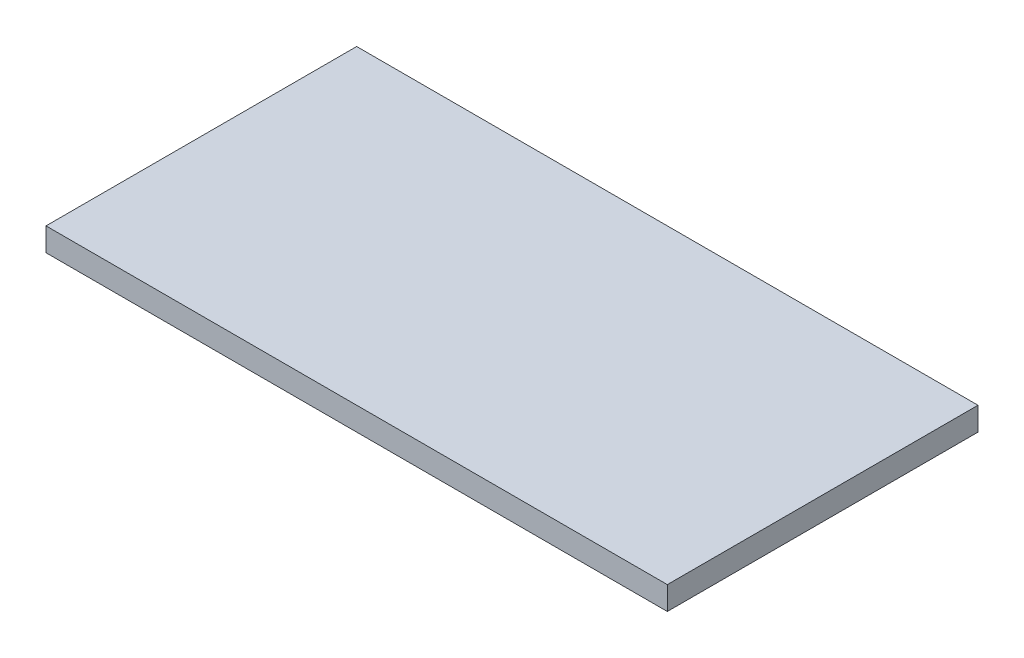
ISO-10303-21;
HEADER;
FILE_DESCRIPTION(('STEP AP214'),'2;1');
FILE_NAME('part.step','',(''),(''),'','','');
FILE_SCHEMA(('AUTOMOTIVE_DESIGN { 1 0 10303 214 1 1 1 1 }'));
ENDSEC;
DATA;
#1=APPLICATION_CONTEXT('core data for automotive mechanical design processes');
#2=APPLICATION_PROTOCOL_DEFINITION('international standard','automotive_design',2000,#1);
#3=PRODUCT_CONTEXT('',#1,'mechanical');
#4=PRODUCT('Part','Part','',(#3));
#5=PRODUCT_RELATED_PRODUCT_CATEGORY('part','',(#4));
#6=PRODUCT_DEFINITION_FORMATION('','',#4);
#7=PRODUCT_DEFINITION_CONTEXT('part definition',#1,'design');
#8=PRODUCT_DEFINITION('design','',#6,#7);
#9=PRODUCT_DEFINITION_SHAPE('','',#8);
#10=(LENGTH_UNIT() NAMED_UNIT(*) SI_UNIT(.MILLI.,.METRE.));
#11=(NAMED_UNIT(*) PLANE_ANGLE_UNIT() SI_UNIT($,.RADIAN.));
#12=(NAMED_UNIT(*) SI_UNIT($,.STERADIAN.) SOLID_ANGLE_UNIT());
#13=UNCERTAINTY_MEASURE_WITH_UNIT(LENGTH_MEASURE(1.E-05),#10,'distance_accuracy_value','');
#14=(GEOMETRIC_REPRESENTATION_CONTEXT(3) GLOBAL_UNCERTAINTY_ASSIGNED_CONTEXT((#13)) GLOBAL_UNIT_ASSIGNED_CONTEXT((#10,
#11,#12)) REPRESENTATION_CONTEXT('',''));
#15=CARTESIAN_POINT('',(0.,0.,0.));
#16=DIRECTION('',(0.,0.,1.));
#17=DIRECTION('',(1.,0.,0.));
#18=AXIS2_PLACEMENT_3D('',#15,#16,#17);
#19=CARTESIAN_POINT('',(63.4999999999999,4.7625,31.75));
#20=DIRECTION('',(-1.,0.,0.));
#21=DIRECTION('',(0.,0.,1.));
#22=AXIS2_PLACEMENT_3D('',#19,#20,#21);
#23=PLANE('',#22);
#24=DIRECTION('',(0.,0.,-1.));
#25=VECTOR('',#24,1.);
#26=CARTESIAN_POINT('',(63.4999999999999,0.,31.75));
#27=LINE('',#26,#25);
#28=CARTESIAN_POINT('',(63.4999999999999,0.,31.75));
#29=VERTEX_POINT('',#28);
#30=CARTESIAN_POINT('',(63.4999999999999,0.,-31.75));
#31=VERTEX_POINT('',#30);
#32=EDGE_CURVE('E103',#29,#31,#27,.T.);
#33=ORIENTED_EDGE('',*,*,#32,.T.);
#34=DIRECTION('',(0.,-1.,0.));
#35=VECTOR('',#34,1.);
#36=CARTESIAN_POINT('',(63.4999999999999,4.7625,-31.75));
#37=LINE('',#36,#35);
#38=CARTESIAN_POINT('',(63.4999999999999,4.7625,-31.75));
#39=VERTEX_POINT('',#38);
#40=EDGE_CURVE('E11',#39,#31,#37,.T.);
#41=ORIENTED_EDGE('',*,*,#40,.F.);
#42=DIRECTION('',(0.,0.,-1.));
#43=VECTOR('',#42,1.);
#44=CARTESIAN_POINT('',(63.4999999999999,4.7625,31.75));
#45=LINE('',#44,#43);
#46=CARTESIAN_POINT('',(63.4999999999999,4.7625,31.75));
#47=VERTEX_POINT('',#46);
#48=EDGE_CURVE('E91',#47,#39,#45,.T.);
#49=ORIENTED_EDGE('',*,*,#48,.F.);
#50=DIRECTION('',(0.,-1.,0.));
#51=VECTOR('',#50,1.);
#52=CARTESIAN_POINT('',(63.4999999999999,4.7625,31.75));
#53=LINE('',#52,#51);
#54=EDGE_CURVE('E99',#47,#29,#53,.T.);
#55=ORIENTED_EDGE('',*,*,#54,.T.);
#56=EDGE_LOOP('',(#33,#41,#49,#55));
#57=FACE_BOUND('',#56,.T.);
#58=ADVANCED_FACE('F40',(#57),#23,.F.);
#59=CARTESIAN_POINT('',(-63.5000000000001,4.7625,-31.75));
#60=DIRECTION('',(0.,0.,1.));
#61=DIRECTION('',(1.,0.,0.));
#62=AXIS2_PLACEMENT_3D('',#59,#60,#61);
#63=PLANE('',#62);
#64=DIRECTION('',(-1.,0.,0.));
#65=VECTOR('',#64,1.);
#66=CARTESIAN_POINT('',(-63.5000000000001,0.,-31.75));
#67=LINE('',#66,#65);
#68=CARTESIAN_POINT('',(-63.5000000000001,0.,-31.75));
#69=VERTEX_POINT('',#68);
#70=EDGE_CURVE('E95',#31,#69,#67,.T.);
#71=ORIENTED_EDGE('',*,*,#70,.T.);
#72=DIRECTION('',(0.,-1.,0.));
#73=VECTOR('',#72,1.);
#74=CARTESIAN_POINT('',(-63.5000000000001,4.7625,-31.75));
#75=LINE('',#74,#73);
#76=CARTESIAN_POINT('',(-63.5000000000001,4.7625,-31.75));
#77=VERTEX_POINT('',#76);
#78=EDGE_CURVE('E48',#77,#69,#75,.T.);
#79=ORIENTED_EDGE('',*,*,#78,.F.);
#80=DIRECTION('',(-1.,0.,0.));
#81=VECTOR('',#80,1.);
#82=CARTESIAN_POINT('',(-63.5000000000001,4.7625,-31.75));
#83=LINE('',#82,#81);
#84=EDGE_CURVE('E86',#39,#77,#83,.T.);
#85=ORIENTED_EDGE('',*,*,#84,.F.);
#86=ORIENTED_EDGE('',*,*,#40,.T.);
#87=EDGE_LOOP('',(#71,#79,#85,#86));
#88=FACE_BOUND('',#87,.T.);
#89=ADVANCED_FACE('F94',(#88),#63,.F.);
#90=CARTESIAN_POINT('',(-63.5000000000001,4.7625,31.75));
#91=DIRECTION('',(1.,0.,0.));
#92=DIRECTION('',(0.,0.,-1.));
#93=AXIS2_PLACEMENT_3D('',#90,#91,#92);
#94=PLANE('',#93);
#95=DIRECTION('',(0.,0.,1.));
#96=VECTOR('',#95,1.);
#97=CARTESIAN_POINT('',(-63.5000000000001,0.,31.75));
#98=LINE('',#97,#96);
#99=CARTESIAN_POINT('',(-63.5000000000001,0.,31.75));
#100=VERTEX_POINT('',#99);
#101=EDGE_CURVE('E73',#69,#100,#98,.T.);
#102=ORIENTED_EDGE('',*,*,#101,.T.);
#103=DIRECTION('',(0.,-1.,0.));
#104=VECTOR('',#103,1.);
#105=CARTESIAN_POINT('',(-63.5000000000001,4.7625,31.75));
#106=LINE('',#105,#104);
#107=CARTESIAN_POINT('',(-63.5000000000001,4.7625,31.75));
#108=VERTEX_POINT('',#107);
#109=EDGE_CURVE('E96',#108,#100,#106,.T.);
#110=ORIENTED_EDGE('',*,*,#109,.F.);
#111=DIRECTION('',(0.,0.,1.));
#112=VECTOR('',#111,1.);
#113=CARTESIAN_POINT('',(-63.5000000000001,4.7625,31.75));
#114=LINE('',#113,#112);
#115=EDGE_CURVE('E89',#77,#108,#114,.T.);
#116=ORIENTED_EDGE('',*,*,#115,.F.);
#117=ORIENTED_EDGE('',*,*,#78,.T.);
#118=EDGE_LOOP('',(#102,#110,#116,#117));
#119=FACE_BOUND('',#118,.T.);
#120=ADVANCED_FACE('F97',(#119),#94,.F.);
#121=CARTESIAN_POINT('',(-63.5000000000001,4.7625,31.75));
#122=DIRECTION('',(0.,0.,-1.));
#123=DIRECTION('',(-1.,0.,0.));
#124=AXIS2_PLACEMENT_3D('',#121,#122,#123);
#125=PLANE('',#124);
#126=DIRECTION('',(1.,0.,0.));
#127=VECTOR('',#126,1.);
#128=CARTESIAN_POINT('',(-63.5000000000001,0.,31.75));
#129=LINE('',#128,#127);
#130=EDGE_CURVE('E79',#100,#29,#129,.T.);
#131=ORIENTED_EDGE('',*,*,#130,.T.);
#132=ORIENTED_EDGE('',*,*,#54,.F.);
#133=DIRECTION('',(1.,0.,0.));
#134=VECTOR('',#133,1.);
#135=CARTESIAN_POINT('',(-63.5000000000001,4.7625,31.75));
#136=LINE('',#135,#134);
#137=EDGE_CURVE('E56',#108,#47,#136,.T.);
#138=ORIENTED_EDGE('',*,*,#137,.F.);
#139=ORIENTED_EDGE('',*,*,#109,.T.);
#140=EDGE_LOOP('',(#131,#132,#138,#139));
#141=FACE_BOUND('',#140,.T.);
#142=ADVANCED_FACE('F110',(#141),#125,.F.);
#143=CARTESIAN_POINT('',(0.,4.7625,0.));
#144=DIRECTION('',(0.,-1.,0.));
#145=DIRECTION('',(0.,0.,-1.));
#146=AXIS2_PLACEMENT_3D('',#143,#144,#145);
#147=PLANE('',#146);
#148=ORIENTED_EDGE('',*,*,#48,.T.);
#149=ORIENTED_EDGE('',*,*,#84,.T.);
#150=ORIENTED_EDGE('',*,*,#115,.T.);
#151=ORIENTED_EDGE('',*,*,#137,.T.);
#152=EDGE_LOOP('',(#148,#149,#150,#151));
#153=FACE_BOUND('',#152,.T.);
#154=ADVANCED_FACE('F87',(#153),#147,.F.);
#155=CARTESIAN_POINT('',(0.,0.,0.));
#156=DIRECTION('',(0.,-1.,0.));
#157=DIRECTION('',(0.,0.,-1.));
#158=AXIS2_PLACEMENT_3D('',#155,#156,#157);
#159=PLANE('',#158);
#160=ORIENTED_EDGE('',*,*,#32,.F.);
#161=ORIENTED_EDGE('',*,*,#130,.F.);
#162=ORIENTED_EDGE('',*,*,#101,.F.);
#163=ORIENTED_EDGE('',*,*,#70,.F.);
#164=EDGE_LOOP('',(#160,#161,#162,#163));
#165=FACE_BOUND('',#164,.T.);
#166=ADVANCED_FACE('F113',(#165),#159,.T.);
#167=CLOSED_SHELL('',(#58,#89,#120,#142,#154,#166));
#168=MANIFOLD_SOLID_BREP('B2',#167);
#169=ADVANCED_BREP_SHAPE_REPRESENTATION('',(#18,#168),#14);
#170=SHAPE_DEFINITION_REPRESENTATION(#9,#169);
ENDSEC;
END-ISO-10303-21;
